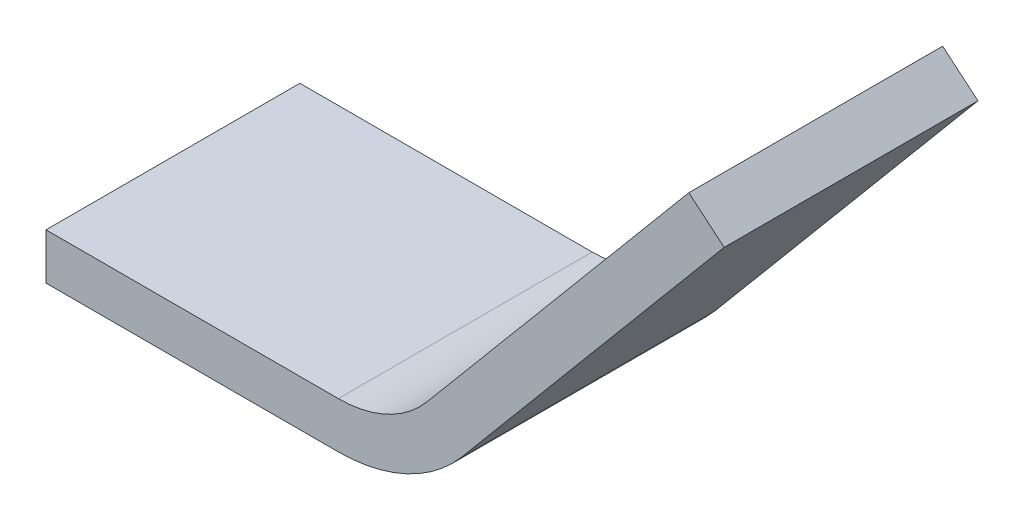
from build123d import *

# Parameters (mm, degrees)
EXTRU_MINCE1_DEPTH = 2.2


with BuildPart() as part:
    # Esquisse1 → Extru.-Mince1 (new body)
    with BuildSketch(Plane.XY):
        with BuildLine():
            Line((2.571150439, 3.064177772), (0.299736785, 0.35721239))
            ThreePointArc((0.299736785, 0.35721239), (-0.043689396, 0.093692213), (-0.466307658, 0))
            Line((-0.466307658, 0), (-3, 0))
            Line((-3, 0), (-3, -0.4))
            Line((-3, -0.4), (-0.466307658, -0.4))
            ThreePointArc((-0.466307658, -0.4), (0.125357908, -0.268830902), (0.606154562, 0.100097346))
            Line((0.606154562, 0.100097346), (2.877568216, 2.807062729))
            Line((2.877568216, 2.807062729), (2.571150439, 3.064177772))
        make_face()
    extrude(amount=EXTRU_MINCE1_DEPTH)


solid = part.part
